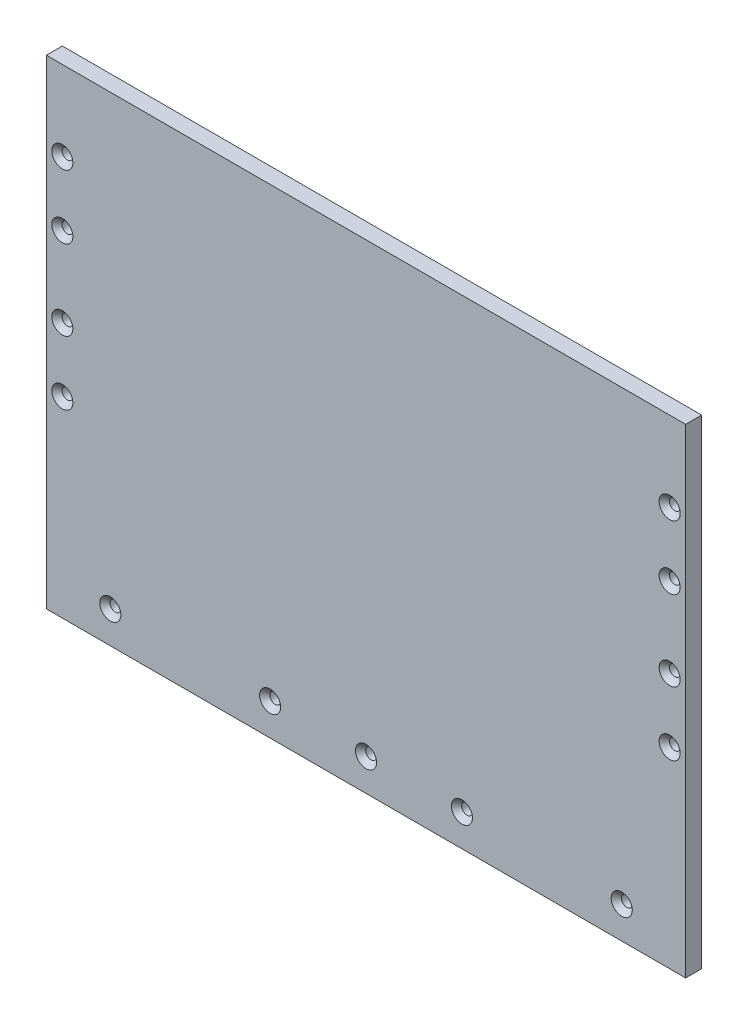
from build123d import *

# Parameters (mm, degrees)
SKETCH_1_W                   = 200
SKETCH_1_H                   = 150
EXTRUDE_1_DEPTH              = 5
HOLE_WIZARD_M3_1_D           = 3.4
HOLE_WIZARD_M3_1_DEPTH       = 11.5
HOLE_WIZARD_M3_1_CSINK_D     = 6.6
HOLE_WIZARD_M3_1_CSINK_ANGLE = 90
HOLE_WIZARD_M3_1_TIP         = 1.021463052


with BuildPart() as part:
    # Sketch 1 → Extrude 1 (new body)
    with BuildSketch(Plane.XY):
        Rectangle(SKETCH_1_W, SKETCH_1_H)
    extrude(amount=EXTRUDE_1_DEPTH)

    # Hole Wizard M3 _1
    with Locations(Plane.XY.offset(5)):
        with Locations((-95, 50), (-95, 30), (-95, 5), (-95, -15), (-80, -65), (95, 50), (95, 30), (95, 5), (95, -15), (80, -65), (-30, -65), (0, -65), (30, -65)):
            CounterSinkHole(HOLE_WIZARD_M3_1_D / 2, HOLE_WIZARD_M3_1_CSINK_D / 2, depth=HOLE_WIZARD_M3_1_DEPTH, counter_sink_angle=HOLE_WIZARD_M3_1_CSINK_ANGLE)
            with Locations((0, 0, -(HOLE_WIZARD_M3_1_DEPTH + HOLE_WIZARD_M3_1_TIP / 2))):  # 118° drill point
                Cone(0, HOLE_WIZARD_M3_1_D / 2, HOLE_WIZARD_M3_1_TIP, mode=Mode.SUBTRACT)


solid = part.part
